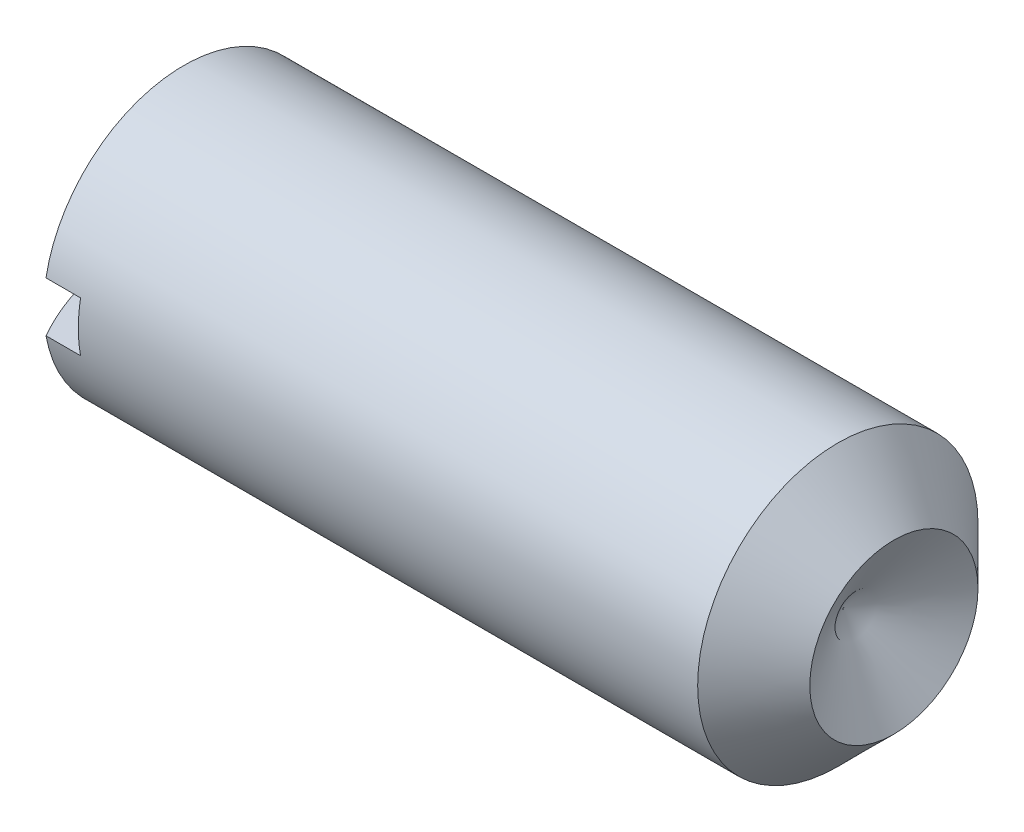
from build123d import *

# Parameters (mm, degrees)
SKETCH2_W  = 19.05
SKETCH2_H  = 3.4036
SLOT_DEPTH = 4.9022


with BuildPart() as part:
    # BodySke → BaseBody (revolve)
    with BuildSketch(Plane.XY):
        with BuildLine():
            Line((2.552216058, 9.525), (46.99, 9.525))
            Line((46.99, 9.525), (50.8, 5.715))
            Line((50.8, 5.715), (47.366081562, 0))
            Line((47.366081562, 0), (0, 0))
            ThreePointArc((0, 0), (0.649113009, 4.930502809), (2.552216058, 9.525))
        make_face()
    revolve(axis=Axis((-12.7, 0, 0), (1, 0, 0)))

    # Sketch2 → Slot (cut)
    with BuildSketch(Plane(origin=(0, 0, 0), x_dir=(0, 0, -1), z_dir=(1, 0, 0))):
        Rectangle(SKETCH2_W, SKETCH2_H)
    extrude(amount=SLOT_DEPTH, mode=Mode.SUBTRACT)


solid = part.part
